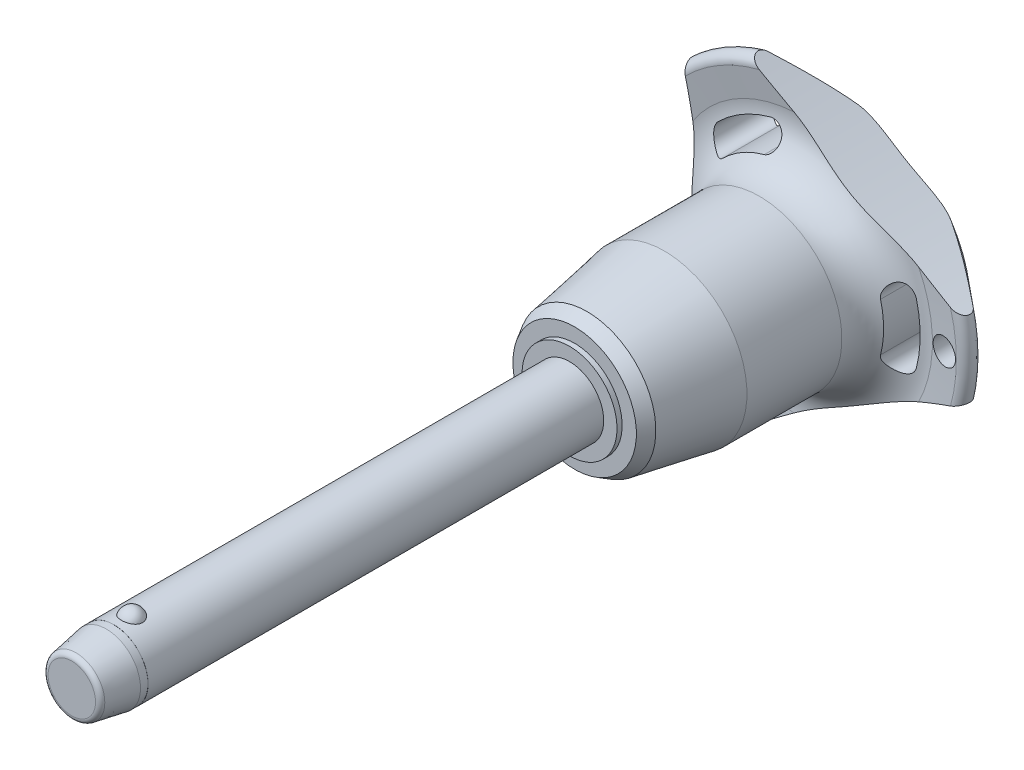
from build123d import *

# Parameters (mm, degrees)
SKETCH1_R           = 4
BOSS_EXTRUDE1_DEPTH = 50
SKETCH2_R           = 3.4
BOSS_EXTRUDE2_DEPTH = 33.3
BOSS_EXTRUDE3_START = 8.2
SKETCH1_2_R         = 4
BOSS_EXTRUDE3_DEPTH = 8.2
CHAMFER1_SIZE       = 4.1
CHAMFER1_SIZE2      = 0.722940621
FILLET1_R           = 0.6
SKETCH6_R           = 102.8
CUT_EXTRUDE1_DEPTH  = 88.794135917
CIRPATTERN1_COUNT   = 3
SKETCH7_R           = 1.5
CUT_EXTRUDE2_DEPTH  = 88.609718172
SKETCH8_R           = 4
SKETCH8_R_2         = 3.99
CUT_EXTRUDE3_DEPTH  = 4.92


with BuildPart() as part:
    # Sketch1 → Boss-Extrude1 (new body)
    with BuildSketch(Plane.XY):
        Circle(SKETCH1_R)
    extrude(amount=-BOSS_EXTRUDE1_DEPTH)

    # Sketch2 → Boss-Extrude2 (add)
    with BuildSketch(Plane(origin=(0, 0, -50), x_dir=(-1, 0, 0), z_dir=(0, 0, -1))):
        Circle(SKETCH2_R)
    extrude(amount=BOSS_EXTRUDE2_DEPTH)

    # Sketch3 → Revolve1 (revolve)
    with BuildSketch(Plane(origin=(0, 0, 0), x_dir=(0, 0, -1), z_dir=(1, 0, 0))):
        with BuildLine():
            Line((-1.2, 4.8), (-1.2, 2.2))
            ThreePointArc((-1.2, 2.2), (0.1, 3.5), (-1.2, 4.8))
        make_face()
        with BuildLine():
            Line((-1.2, -2.2), (-1.2, -4.8))
            ThreePointArc((-1.2, -4.8), (0.1, -3.5), (-1.2, -2.2))
        make_face()
    revolve(axis=Axis((0, -2.2, 1.2), (0, 1, 0)))

    # Sketch1_2 → Boss-Extrude3 (add)
    with BuildSketch(Plane.XY.offset(BOSS_EXTRUDE3_START)):
        Circle(SKETCH1_2_R)
    extrude(amount=-BOSS_EXTRUDE3_DEPTH)

    # Chamfer1
    chamfer1_edges = [part.edges().sort_by_distance(p)[0] for p in [
        (-4, 0, 8.2),
    ]]
    chamfer1_side = [part.faces().sort_by_distance(p)[0] for p in [
        (-4, 0, -20.9),
    ]]
    chamfer(chamfer1_edges, length=CHAMFER1_SIZE, length2=CHAMFER1_SIZE2, reference=chamfer1_side[0])

    # Fillet1
    fillet1_edges = [part.edges().sort_by_distance(p)[0] for p in [
        (-3.277059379, 0, 8.2),
        (3.4, 0, -83.3),
    ]]
    fillet(fillet1_edges, radius=FILLET1_R)

    # Sketch4 → Revolve2 (revolve)
    with BuildSketch(Plane(origin=(0, 0, 0), x_dir=(0, 0, -1), z_dir=(1, 0, 0)), mode=Mode.PRIVATE) as revolve2_sk:
        Polygon((50, 0), (50, 5.554101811), (50.6, 5.554101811), (50.6, 7.220004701), (52.042714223, 8.052956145), (61.1, 9.65), (72.2, 9.65), (72.2, 0), align=None)
    revolve(revolve2_sk.sketch.rotate(Axis((0, 0, -72.2), (0, 0, 1)), 90), axis=Axis((0, 0, -72.2), (0, 0, 1)))

    # Sketch5 → Revolve3 (revolve)
    with BuildSketch(Plane(origin=(0, 0, 0), x_dir=(0, 0, -1), z_dir=(1, 0, 0)), mode=Mode.PRIVATE) as revolve3_sk:
        with BuildLine():
            Line((77.16082631, 15.274661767), (76.757834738, 18.475067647))
            ThreePointArc((76.757834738, 18.475067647), (77.349836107, 19.516443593), (78.516044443, 19.24278761))
            Line((78.516044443, 19.24278761), (82.835691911, 14.094832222))
            ThreePointArc((82.835691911, 14.094832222), (83.3, 12.689260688), (82.67067517, 11.349423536))
            ThreePointArc((82.67067517, 11.349423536), (79.033110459, 6.185112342), (77.75, 0))
            Line((77.75, 0), (72.2, 0))
            Line((72.2, 0), (72.2, 9.65))
            ThreePointArc((72.2, 9.65), (75.949887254, 11.342683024), (77.16082631, 15.274661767))
        make_face()
    revolve(revolve3_sk.sketch.rotate(Axis((0, 0, -77.75), (0, 0, 1)), 90), axis=Axis((0, 0, -77.75), (0, 0, 1)))

    # Sketch6 → Cut-Extrude1 (cut, through all)
    with BuildSketch(Plane.XY):
        with Locations((-115.2, 0)):
            Circle(SKETCH6_R)
        with BuildLine():
            ThreePointArc((13.411913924, -3.529271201), (13.868496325, 0), (13.411913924, 3.529271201))
            ThreePointArc((13.411913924, 3.529271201), (11.694200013, 4.531299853), (10.692171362, 2.813585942))
            ThreePointArc((10.692171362, 2.813585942), (11.056165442, 0), (10.692171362, -2.813585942))
            ThreePointArc((10.692171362, -2.813585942), (11.694200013, -4.531299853), (13.411913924, -3.529271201))
        make_face()
    cut_extrude1 = extrude(amount=-CUT_EXTRUDE1_DEPTH, mode=Mode.SUBTRACT)

    # CirPattern1: Cut-Extrude1 ×3 about axis
    cirpattern1_axis = Axis((0, 0, 0), (0, 0, 1))
    for i in range(1, CIRPATTERN1_COUNT):
        add(cut_extrude1.rotate(cirpattern1_axis, i * 360 / CIRPATTERN1_COUNT), mode=Mode.SUBTRACT)

    # Sketch7 → Cut-Extrude2 (cut, through all)
    with BuildSketch(Plane.XY):
        with Locations(Location((16.868496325, 0, 0), (0, 0, 225.467095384))):
            Circle(SKETCH7_R)
    extrude(amount=-CUT_EXTRUDE2_DEPTH, mode=Mode.SUBTRACT)

    # Sketch8 → Cut-Extrude3 (cut)
    with BuildSketch(Plane.XY.offset(8.2)):
        Circle(SKETCH8_R)
        Circle(SKETCH8_R_2, mode=Mode.SUBTRACT)
    extrude(amount=-CUT_EXTRUDE3_DEPTH, mode=Mode.SUBTRACT)


solid = part.part
